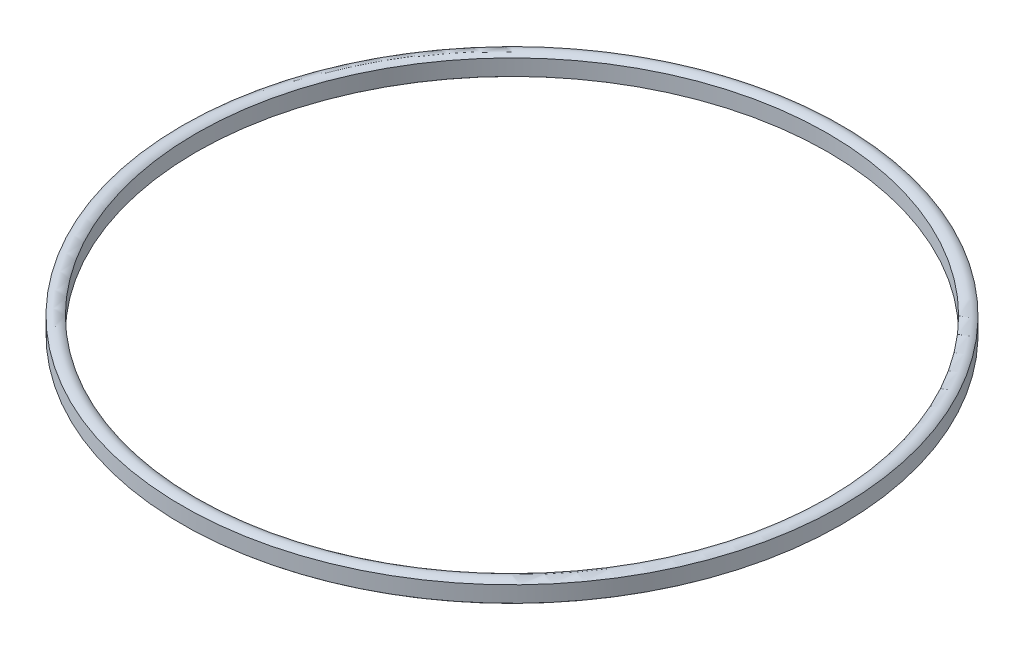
from build123d import *


with BuildPart() as part:
    # Sketch2 → Revolve2 (revolve)
    with BuildSketch(Plane.XY):
        with BuildLine():
            ThreePointArc((-29.9, 0.759934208), (-30.203542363, 0.938065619), (-30.550000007, 1))
            ThreePointArc((-30.550000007, 1), (-30.896457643, 0.938065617), (-31.2, 0.759934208))
            Line((-31.2, 0.759934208), (-31.2, -0.759934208))
            ThreePointArc((-31.2, -0.759934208), (-30.89645764, -0.938065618), (-30.55, -1))
            ThreePointArc((-30.55, -1), (-30.20354236, -0.938065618), (-29.9, -0.759934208))
            Line((-29.9, -0.759934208), (-29.9, 0.759934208))
        make_face()
    revolve(axis=Axis((0, 10.469650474, 0), (0, -1, 0)))


solid = part.part
